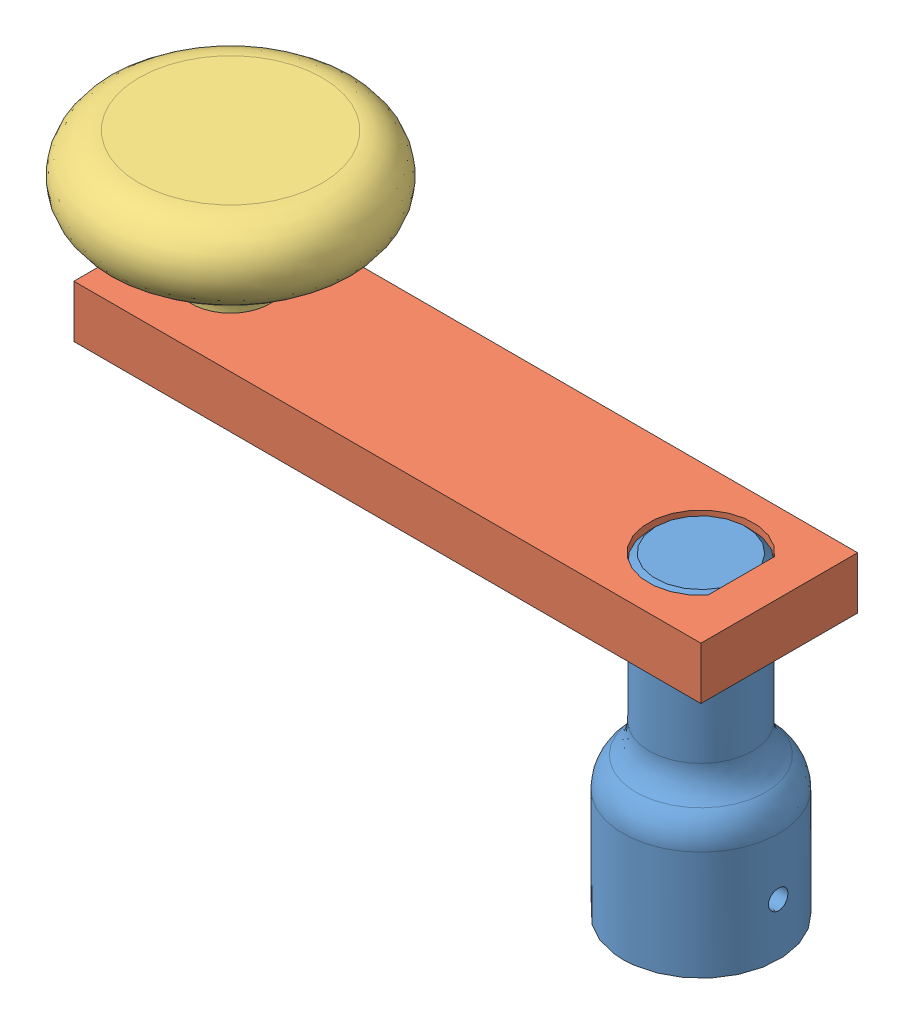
SolidWorks assembly crank sub_&.SLDASM, configuration Default (file format 9000). Lengths in mm.
Overall size (88.61 53.98 43.88).
3 component instances, 3 part files, 5 mates.
Components (placement in the parent):
- crank-shaft._&-1: crank-shaft._&.sldprt [Default] at origin size (18.92 38.1 18.92)
- crank-arm_&-1: crank-arm_&.sldprt [Default] at (-66.675 31.75 -9.525) size (76.2 6.35 19.05)
- crank-knob_&-1: crank-knob_&.sldprt [Default] at (-57.15 31.75 0) x (-0.84105 0 -0.540957) z (0.540957 0 -0.84105) size (31.75 22.23 31.75)
Mates (geometry in assembly coordinates):
- Concentric1: concentric anti-aligned: cylinder of crank-shaft._&-1 through (0 38.1 0) axis (0 -1 0) radius 6.2865; cylinder of crank-arm_&-1 through (0 31.75 0) axis (0 1 0) radius 6.35
- Coincident1: coincident anti-aligned: plane of crank-shaft._&-1 through (4.8895 31.75 3.9513) normal (1 0 0); plane of crank-arm_&-1 through (4.8895 31.75 -4.0516) normal (-1 0 0)
- Coincident2: coincident: plane of crank-shaft._&-1 through (0 31.75 0) normal (0 1 0); line of crank-arm_&-1 through (9.525 31.75 9.525) axis (0 0 -1)
- Concentric2: concentric anti-aligned: cylinder of crank-arm_&-1 through (-57.15 31.75 0) axis (0 1 0) radius 2.3813; cylinder of crank-knob_&-1 through (-57.15 31.75 0) axis (0 -1 0) radius 2.286
- Coincident3: coincident anti-aligned: plane of crank-arm_&-1 through (9.525 38.1 9.525) normal (0 1 0); plane of crank-knob_&-1 through (-61.1555 38.1 -2.5763) normal (0 -1 0)
